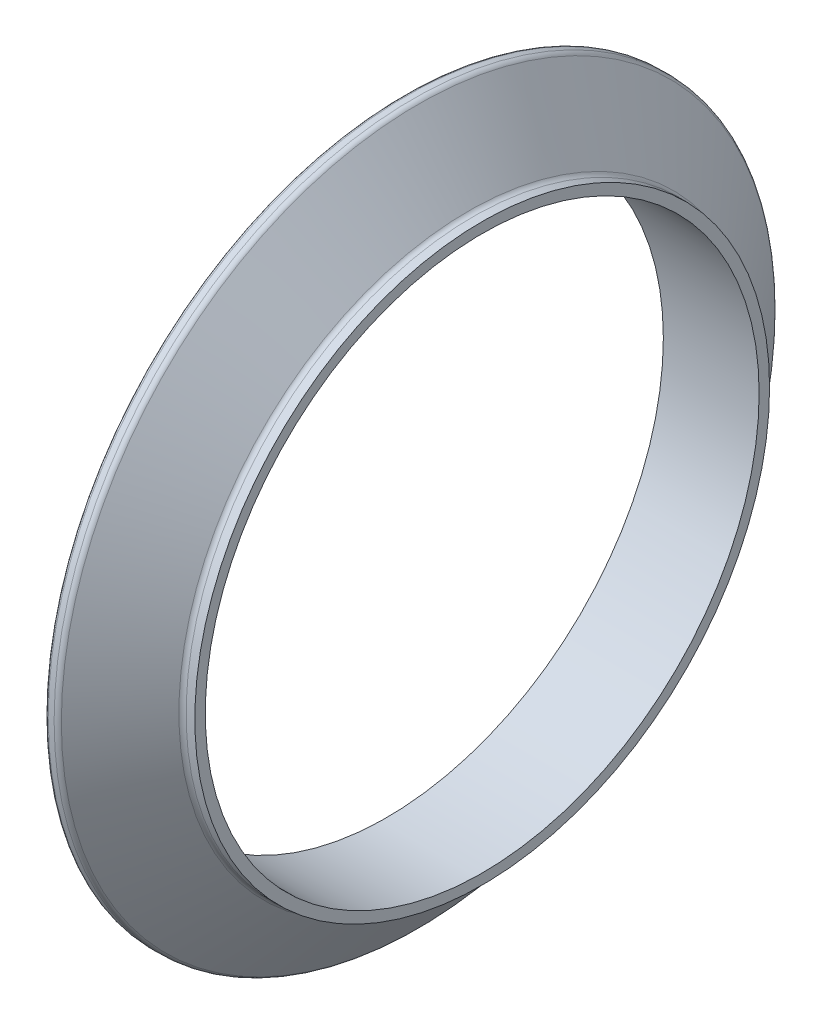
ISO-10303-21;
HEADER;
FILE_DESCRIPTION(('STEP AP214'),'2;1');
FILE_NAME('part.step','',(''),(''),'','','');
FILE_SCHEMA(('AUTOMOTIVE_DESIGN { 1 0 10303 214 1 1 1 1 }'));
ENDSEC;
DATA;
#1=APPLICATION_CONTEXT('core data for automotive mechanical design processes');
#2=APPLICATION_PROTOCOL_DEFINITION('international standard','automotive_design',2000,#1);
#3=PRODUCT_CONTEXT('',#1,'mechanical');
#4=PRODUCT('Part','Part','',(#3));
#5=PRODUCT_RELATED_PRODUCT_CATEGORY('part','',(#4));
#6=PRODUCT_DEFINITION_FORMATION('','',#4);
#7=PRODUCT_DEFINITION_CONTEXT('part definition',#1,'design');
#8=PRODUCT_DEFINITION('design','',#6,#7);
#9=PRODUCT_DEFINITION_SHAPE('','',#8);
#10=(LENGTH_UNIT() NAMED_UNIT(*) SI_UNIT(.MILLI.,.METRE.));
#11=(NAMED_UNIT(*) PLANE_ANGLE_UNIT() SI_UNIT($,.RADIAN.));
#12=(NAMED_UNIT(*) SI_UNIT($,.STERADIAN.) SOLID_ANGLE_UNIT());
#13=UNCERTAINTY_MEASURE_WITH_UNIT(LENGTH_MEASURE(1.E-05),#10,'distance_accuracy_value','');
#14=(GEOMETRIC_REPRESENTATION_CONTEXT(3) GLOBAL_UNCERTAINTY_ASSIGNED_CONTEXT((#13)) GLOBAL_UNIT_ASSIGNED_CONTEXT((#10,
#11,#12)) REPRESENTATION_CONTEXT('',''));
#15=CARTESIAN_POINT('',(0.,0.,0.));
#16=DIRECTION('',(0.,0.,1.));
#17=DIRECTION('',(1.,0.,0.));
#18=AXIS2_PLACEMENT_3D('',#15,#16,#17);
#19=CARTESIAN_POINT('',(0.,76.2,0.));
#20=DIRECTION('',(1.,0.,0.));
#21=DIRECTION('',(0.,0.,-1.));
#22=AXIS2_PLACEMENT_3D('',#19,#20,#21);
#23=PLANE('',#22);
#24=CARTESIAN_POINT('',(0.,0.,0.));
#25=DIRECTION('',(1.,0.,0.));
#26=DIRECTION('',(0.,0.,-1.));
#27=AXIS2_PLACEMENT_3D('',#24,#25,#26);
#28=CIRCLE('',#27,76.2);
#29=CARTESIAN_POINT('',(0.,0.,-76.2));
#30=VERTEX_POINT('',#29);
#31=EDGE_CURVE('E12',#30,#30,#28,.T.);
#32=ORIENTED_EDGE('',*,*,#31,.T.);
#33=EDGE_LOOP('',(#32));
#34=FACE_BOUND('',#33,.T.);
#35=CARTESIAN_POINT('',(0.,0.,0.));
#36=DIRECTION('',(1.,0.,0.));
#37=DIRECTION('',(0.,0.,-1.));
#38=AXIS2_PLACEMENT_3D('',#35,#36,#37);
#39=CIRCLE('',#38,73.4314);
#40=CARTESIAN_POINT('',(0.,0.,-73.4314));
#41=VERTEX_POINT('',#40);
#42=EDGE_CURVE('E83',#41,#41,#39,.T.);
#43=ORIENTED_EDGE('',*,*,#42,.F.);
#44=EDGE_LOOP('',(#43));
#45=FACE_BOUND('',#44,.T.);
#46=ADVANCED_FACE('F40',(#34,#45),#23,.T.);
#47=CARTESIAN_POINT('',(0.,0.,0.));
#48=DIRECTION('',(1.,0.,0.));
#49=DIRECTION('',(0.,0.,-1.));
#50=AXIS2_PLACEMENT_3D('',#47,#48,#49);
#51=CYLINDRICAL_SURFACE('',#50,76.2);
#52=CARTESIAN_POINT('',(-2.30946505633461,0.,0.));
#53=DIRECTION('',(1.,0.,0.));
#54=DIRECTION('',(0.,0.,-1.));
#55=AXIS2_PLACEMENT_3D('',#52,#53,#54);
#56=CIRCLE('',#55,76.2);
#57=CARTESIAN_POINT('',(-2.30946505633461,0.,-76.2));
#58=VERTEX_POINT('',#57);
#59=EDGE_CURVE('E46',#58,#58,#56,.T.);
#60=ORIENTED_EDGE('',*,*,#59,.T.);
#61=EDGE_LOOP('',(#60));
#62=FACE_BOUND('',#61,.T.);
#63=ORIENTED_EDGE('',*,*,#31,.F.);
#64=EDGE_LOOP('',(#63));
#65=FACE_BOUND('',#64,.T.);
#66=ADVANCED_FACE('F91',(#62,#65),#51,.T.);
#67=CARTESIAN_POINT('',(-2.30946505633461,0.,0.));
#68=DIRECTION('',(1.,0.,0.));
#69=DIRECTION('',(0.,0.,-1.));
#70=AXIS2_PLACEMENT_3D('',#67,#68,#69);
#71=TOROIDAL_SURFACE('',#70,77.8002,1.60019999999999);
#72=CARTESIAN_POINT('',(-3.58744159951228,0.,0.));
#73=DIRECTION('',(1.,0.,0.));
#74=DIRECTION('',(0.,0.,-1.));
#75=AXIS2_PLACEMENT_3D('',#72,#73,#74);
#76=CIRCLE('',#75,76.8371755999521);
#77=CARTESIAN_POINT('',(-3.58744159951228,0.,-76.8371755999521));
#78=VERTEX_POINT('',#77);
#79=EDGE_CURVE('E50',#78,#78,#76,.T.);
#80=ORIENTED_EDGE('',*,*,#79,.T.);
#81=EDGE_LOOP('',(#80));
#82=FACE_BOUND('',#81,.T.);
#83=ORIENTED_EDGE('',*,*,#59,.F.);
#84=EDGE_LOOP('',(#83));
#85=FACE_BOUND('',#84,.T.);
#86=ADVANCED_FACE('F95',(#82,#85),#71,.F.);
#87=CARTESIAN_POINT('',(-3.58744159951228,0.,0.));
#88=DIRECTION('',(-1.,0.,0.));
#89=DIRECTION('',(0.,0.,1.));
#90=AXIS2_PLACEMENT_3D('',#87,#88,#89);
#91=CONICAL_SURFACE('',#90,76.8371755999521,0.925024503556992);
#92=CARTESIAN_POINT('',(-16.9823537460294,0.,0.));
#93=DIRECTION('',(1.,0.,0.));
#94=DIRECTION('',(0.,0.,-1.));
#95=AXIS2_PLACEMENT_3D('',#92,#93,#94);
#96=CIRCLE('',#95,94.6128244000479);
#97=CARTESIAN_POINT('',(-16.9823537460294,0.,-94.6128244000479));
#98=VERTEX_POINT('',#97);
#99=EDGE_CURVE('E54',#98,#98,#96,.T.);
#100=ORIENTED_EDGE('',*,*,#99,.T.);
#101=EDGE_LOOP('',(#100));
#102=FACE_BOUND('',#101,.T.);
#103=ORIENTED_EDGE('',*,*,#79,.F.);
#104=EDGE_LOOP('',(#103));
#105=FACE_BOUND('',#104,.T.);
#106=ADVANCED_FACE('F99',(#102,#105),#91,.T.);
#107=CARTESIAN_POINT('',(-18.2603302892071,0.,0.));
#108=DIRECTION('',(1.,0.,0.));
#109=DIRECTION('',(0.,0.,-1.));
#110=AXIS2_PLACEMENT_3D('',#107,#108,#109);
#111=TOROIDAL_SURFACE('',#110,93.6498,1.6002);
#112=CARTESIAN_POINT('',(-18.2603302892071,0.,0.));
#113=DIRECTION('',(1.,0.,0.));
#114=DIRECTION('',(0.,0.,-1.));
#115=AXIS2_PLACEMENT_3D('',#112,#113,#114);
#116=CIRCLE('',#115,95.25);
#117=CARTESIAN_POINT('',(-18.2603302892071,0.,-95.25));
#118=VERTEX_POINT('',#117);
#119=EDGE_CURVE('E59',#118,#118,#116,.T.);
#120=ORIENTED_EDGE('',*,*,#119,.T.);
#121=EDGE_LOOP('',(#120));
#122=FACE_BOUND('',#121,.T.);
#123=ORIENTED_EDGE('',*,*,#99,.F.);
#124=EDGE_LOOP('',(#123));
#125=FACE_BOUND('',#124,.T.);
#126=ADVANCED_FACE('F106',(#122,#125),#111,.T.);
#127=CARTESIAN_POINT('',(0.,0.,0.));
#128=DIRECTION('',(1.,0.,0.));
#129=DIRECTION('',(0.,0.,-1.));
#130=AXIS2_PLACEMENT_3D('',#127,#128,#129);
#131=CYLINDRICAL_SURFACE('',#130,95.25);
#132=CARTESIAN_POINT('',(-19.8247,0.,0.));
#133=DIRECTION('',(1.,0.,0.));
#134=DIRECTION('',(0.,0.,-1.));
#135=AXIS2_PLACEMENT_3D('',#132,#133,#134);
#136=CIRCLE('',#135,95.25);
#137=CARTESIAN_POINT('',(-19.8247,0.,-95.25));
#138=VERTEX_POINT('',#137);
#139=EDGE_CURVE('E62',#138,#138,#136,.T.);
#140=ORIENTED_EDGE('',*,*,#139,.T.);
#141=EDGE_LOOP('',(#140));
#142=FACE_BOUND('',#141,.T.);
#143=ORIENTED_EDGE('',*,*,#119,.F.);
#144=EDGE_LOOP('',(#143));
#145=FACE_BOUND('',#144,.T.);
#146=ADVANCED_FACE('F110',(#142,#145),#131,.T.);
#147=CARTESIAN_POINT('',(-19.8247,0.,0.));
#148=DIRECTION('',(1.,0.,0.));
#149=DIRECTION('',(0.,0.,-1.));
#150=AXIS2_PLACEMENT_3D('',#147,#148,#149);
#151=TOROIDAL_SURFACE('',#150,94.4372,0.812799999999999);
#152=CARTESIAN_POINT('',(-20.6375,0.,0.));
#153=DIRECTION('',(1.,0.,0.));
#154=DIRECTION('',(0.,0.,-1.));
#155=AXIS2_PLACEMENT_3D('',#152,#153,#154);
#156=CIRCLE('',#155,94.4372);
#157=CARTESIAN_POINT('',(-20.6375,0.,-94.4372));
#158=VERTEX_POINT('',#157);
#159=EDGE_CURVE('E65',#158,#158,#156,.T.);
#160=ORIENTED_EDGE('',*,*,#159,.T.);
#161=EDGE_LOOP('',(#160));
#162=FACE_BOUND('',#161,.T.);
#163=ORIENTED_EDGE('',*,*,#139,.F.);
#164=EDGE_LOOP('',(#163));
#165=FACE_BOUND('',#164,.T.);
#166=ADVANCED_FACE('F114',(#162,#165),#151,.T.);
#167=CARTESIAN_POINT('',(-20.6375,87.5792,0.));
#168=DIRECTION('',(-1.,0.,0.));
#169=DIRECTION('',(0.,0.,1.));
#170=AXIS2_PLACEMENT_3D('',#167,#168,#169);
#171=PLANE('',#170);
#172=CARTESIAN_POINT('',(-20.6375,0.,0.));
#173=DIRECTION('',(1.,0.,0.));
#174=DIRECTION('',(0.,0.,-1.));
#175=AXIS2_PLACEMENT_3D('',#172,#173,#174);
#176=CIRCLE('',#175,87.5792);
#177=CARTESIAN_POINT('',(-20.6375,0.,-87.5792));
#178=VERTEX_POINT('',#177);
#179=EDGE_CURVE('E68',#178,#178,#176,.T.);
#180=ORIENTED_EDGE('',*,*,#179,.T.);
#181=EDGE_LOOP('',(#180));
#182=FACE_BOUND('',#181,.T.);
#183=ORIENTED_EDGE('',*,*,#159,.F.);
#184=EDGE_LOOP('',(#183));
#185=FACE_BOUND('',#184,.T.);
#186=ADVANCED_FACE('F118',(#182,#185),#171,.T.);
#187=CARTESIAN_POINT('',(-21.4503,0.,0.));
#188=DIRECTION('',(1.,0.,0.));
#189=DIRECTION('',(0.,0.,-1.));
#190=AXIS2_PLACEMENT_3D('',#187,#188,#189);
#191=TOROIDAL_SURFACE('',#190,87.5792,0.812800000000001);
#192=CARTESIAN_POINT('',(-21.4503,0.,0.));
#193=DIRECTION('',(1.,0.,0.));
#194=DIRECTION('',(0.,0.,-1.));
#195=AXIS2_PLACEMENT_3D('',#192,#193,#194);
#196=CIRCLE('',#195,86.7664);
#197=CARTESIAN_POINT('',(-21.4503,0.,-86.7664));
#198=VERTEX_POINT('',#197);
#199=EDGE_CURVE('E71',#198,#198,#196,.T.);
#200=ORIENTED_EDGE('',*,*,#199,.T.);
#201=EDGE_LOOP('',(#200));
#202=FACE_BOUND('',#201,.T.);
#203=ORIENTED_EDGE('',*,*,#179,.F.);
#204=EDGE_LOOP('',(#203));
#205=FACE_BOUND('',#204,.T.);
#206=ADVANCED_FACE('F122',(#202,#205),#191,.F.);
#207=CARTESIAN_POINT('',(0.,0.,0.));
#208=DIRECTION('',(1.,0.,0.));
#209=DIRECTION('',(0.,0.,-1.));
#210=AXIS2_PLACEMENT_3D('',#207,#208,#209);
#211=CYLINDRICAL_SURFACE('',#210,86.7664);
#212=CARTESIAN_POINT('',(-24.5872,0.,0.));
#213=DIRECTION('',(1.,0.,0.));
#214=DIRECTION('',(0.,0.,-1.));
#215=AXIS2_PLACEMENT_3D('',#212,#213,#214);
#216=CIRCLE('',#215,86.7664);
#217=CARTESIAN_POINT('',(-24.5872,0.,-86.7664));
#218=VERTEX_POINT('',#217);
#219=EDGE_CURVE('E74',#218,#218,#216,.T.);
#220=ORIENTED_EDGE('',*,*,#219,.T.);
#221=EDGE_LOOP('',(#220));
#222=FACE_BOUND('',#221,.T.);
#223=ORIENTED_EDGE('',*,*,#199,.F.);
#224=EDGE_LOOP('',(#223));
#225=FACE_BOUND('',#224,.T.);
#226=ADVANCED_FACE('F126',(#222,#225),#211,.T.);
#227=CARTESIAN_POINT('',(-24.5872,0.,0.));
#228=DIRECTION('',(1.,0.,0.));
#229=DIRECTION('',(0.,0.,-1.));
#230=AXIS2_PLACEMENT_3D('',#227,#228,#229);
#231=TOROIDAL_SURFACE('',#230,85.9536,0.812800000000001);
#232=CARTESIAN_POINT('',(-25.4,0.,0.));
#233=DIRECTION('',(1.,0.,0.));
#234=DIRECTION('',(0.,0.,-1.));
#235=AXIS2_PLACEMENT_3D('',#232,#233,#234);
#236=CIRCLE('',#235,85.9536);
#237=CARTESIAN_POINT('',(-25.4,0.,-85.9536));
#238=VERTEX_POINT('',#237);
#239=EDGE_CURVE('E77',#238,#238,#236,.T.);
#240=ORIENTED_EDGE('',*,*,#239,.T.);
#241=EDGE_LOOP('',(#240));
#242=FACE_BOUND('',#241,.T.);
#243=ORIENTED_EDGE('',*,*,#219,.F.);
#244=EDGE_LOOP('',(#243));
#245=FACE_BOUND('',#244,.T.);
#246=ADVANCED_FACE('F130',(#242,#245),#231,.T.);
#247=CARTESIAN_POINT('',(-25.4,73.4314,0.));
#248=DIRECTION('',(-1.,0.,0.));
#249=DIRECTION('',(0.,0.,1.));
#250=AXIS2_PLACEMENT_3D('',#247,#248,#249);
#251=PLANE('',#250);
#252=CARTESIAN_POINT('',(-25.4,0.,0.));
#253=DIRECTION('',(1.,0.,0.));
#254=DIRECTION('',(0.,0.,-1.));
#255=AXIS2_PLACEMENT_3D('',#252,#253,#254);
#256=CIRCLE('',#255,73.4314);
#257=CARTESIAN_POINT('',(-25.4,0.,-73.4314));
#258=VERTEX_POINT('',#257);
#259=EDGE_CURVE('E80',#258,#258,#256,.T.);
#260=ORIENTED_EDGE('',*,*,#259,.T.);
#261=EDGE_LOOP('',(#260));
#262=FACE_BOUND('',#261,.T.);
#263=ORIENTED_EDGE('',*,*,#239,.F.);
#264=EDGE_LOOP('',(#263));
#265=FACE_BOUND('',#264,.T.);
#266=ADVANCED_FACE('F134',(#262,#265),#251,.T.);
#267=CARTESIAN_POINT('',(0.,0.,0.));
#268=DIRECTION('',(1.,0.,0.));
#269=DIRECTION('',(0.,0.,-1.));
#270=AXIS2_PLACEMENT_3D('',#267,#268,#269);
#271=CYLINDRICAL_SURFACE('',#270,73.4314);
#272=ORIENTED_EDGE('',*,*,#42,.T.);
#273=EDGE_LOOP('',(#272));
#274=FACE_BOUND('',#273,.T.);
#275=ORIENTED_EDGE('',*,*,#259,.F.);
#276=EDGE_LOOP('',(#275));
#277=FACE_BOUND('',#276,.T.);
#278=ADVANCED_FACE('F87',(#274,#277),#271,.F.);
#279=CLOSED_SHELL('',(#46,#66,#86,#106,#126,#146,#166,#186,#206,#226,#246,#266,#278));
#280=MANIFOLD_SOLID_BREP('B2',#279);
#281=ADVANCED_BREP_SHAPE_REPRESENTATION('',(#18,#280),#14);
#282=SHAPE_DEFINITION_REPRESENTATION(#9,#281);
ENDSEC;
END-ISO-10303-21;
